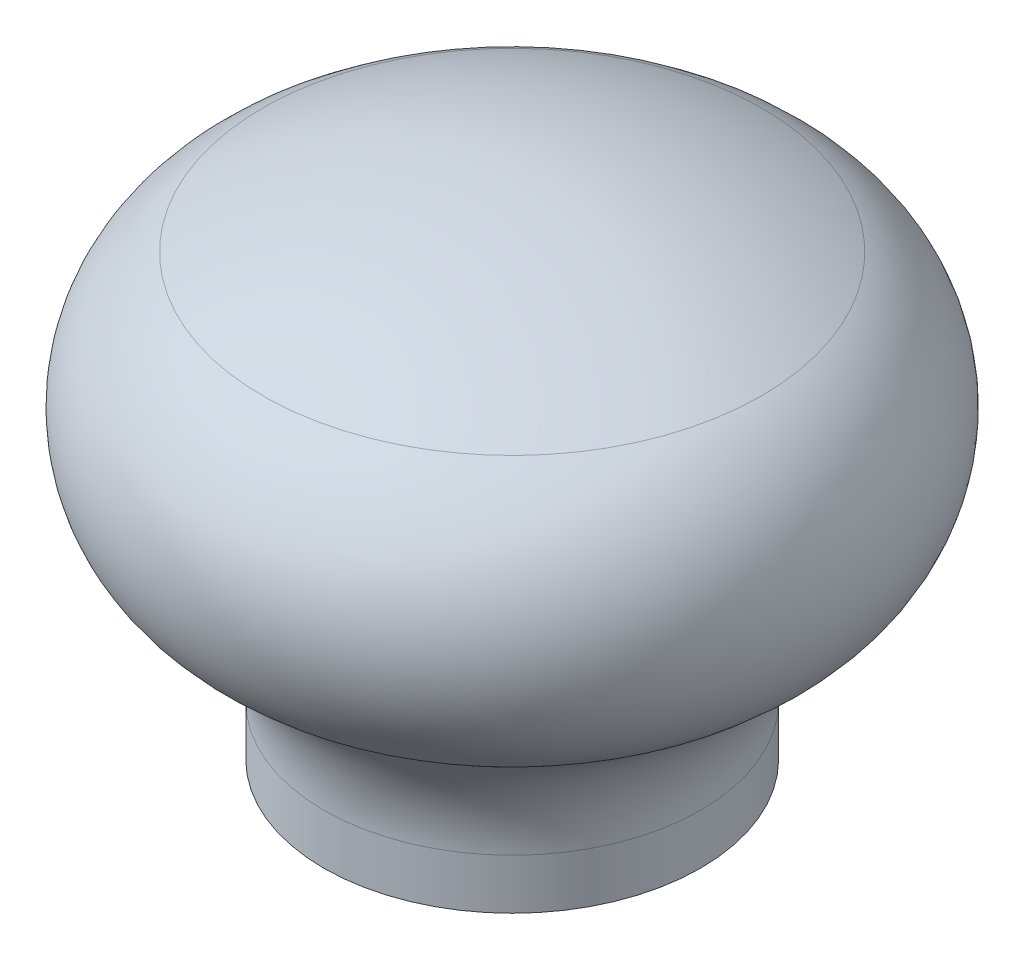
from build123d import *


with BuildPart() as part:
    # Sketch2 → Revolve1 (revolve)
    with BuildSketch(Plane.XY, mode=Mode.PRIVATE) as revolve1_sk:
        with BuildLine():
            Line((-9.525, 0), (-9.525, 2.54))
            ThreePointArc((-9.525, 2.54), (-10.463552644, 6.169929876), (-13.043957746, 8.89))
            ThreePointArc((-13.043957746, 8.89), (-16.664633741, 15.682949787), (-12.608152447, 22.225))
            ThreePointArc((-12.608152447, 22.225), (-6.500887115, 24.594050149), (0, 25.4))
            Line((0, 25.4), (0, 9.263922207))
            Line((0, 9.263922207), (-2.0828, 9.263922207))
            Line((-2.0828, 9.263922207), (-2.0828, 0))
            Line((-2.0828, 0), (-9.525, 0))
        make_face()
    revolve(revolve1_sk.sketch.rotate(Axis((0, 0, 0), (0, 1, 0)), 270), axis=Axis((0, 0, 0), (0, 1, 0)))


solid = part.part
